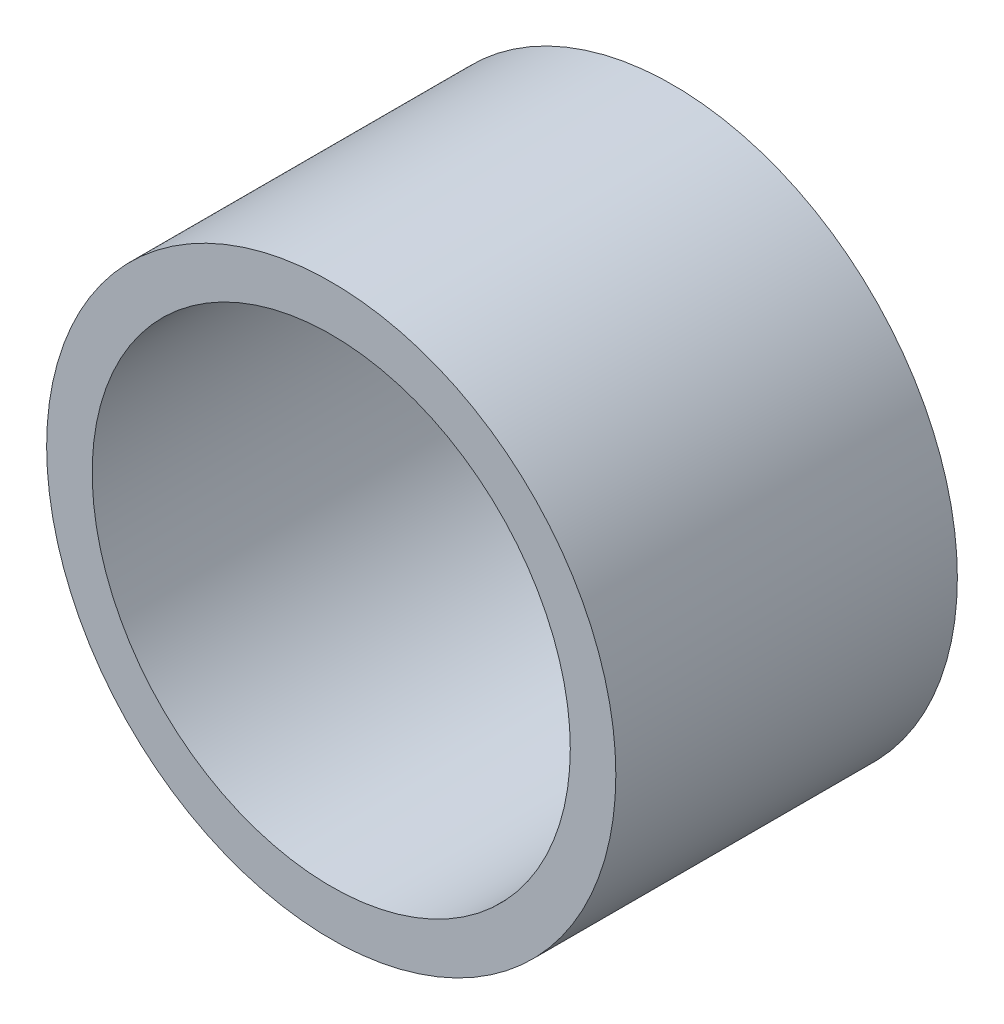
from build123d import *

# Parameters (mm, degrees)
ESQUISSE1_R      = 12.5
ESQUISSE1_R_2    = 10.5
EXTRUSION1_DEPTH = 15


with BuildPart() as part:
    # Esquisse1 → Extrusion1 (new body)
    with BuildSketch(Plane.XY):
        Circle(ESQUISSE1_R)
        Circle(ESQUISSE1_R_2, mode=Mode.SUBTRACT)
    extrude(amount=EXTRUSION1_DEPTH)


solid = part.part
